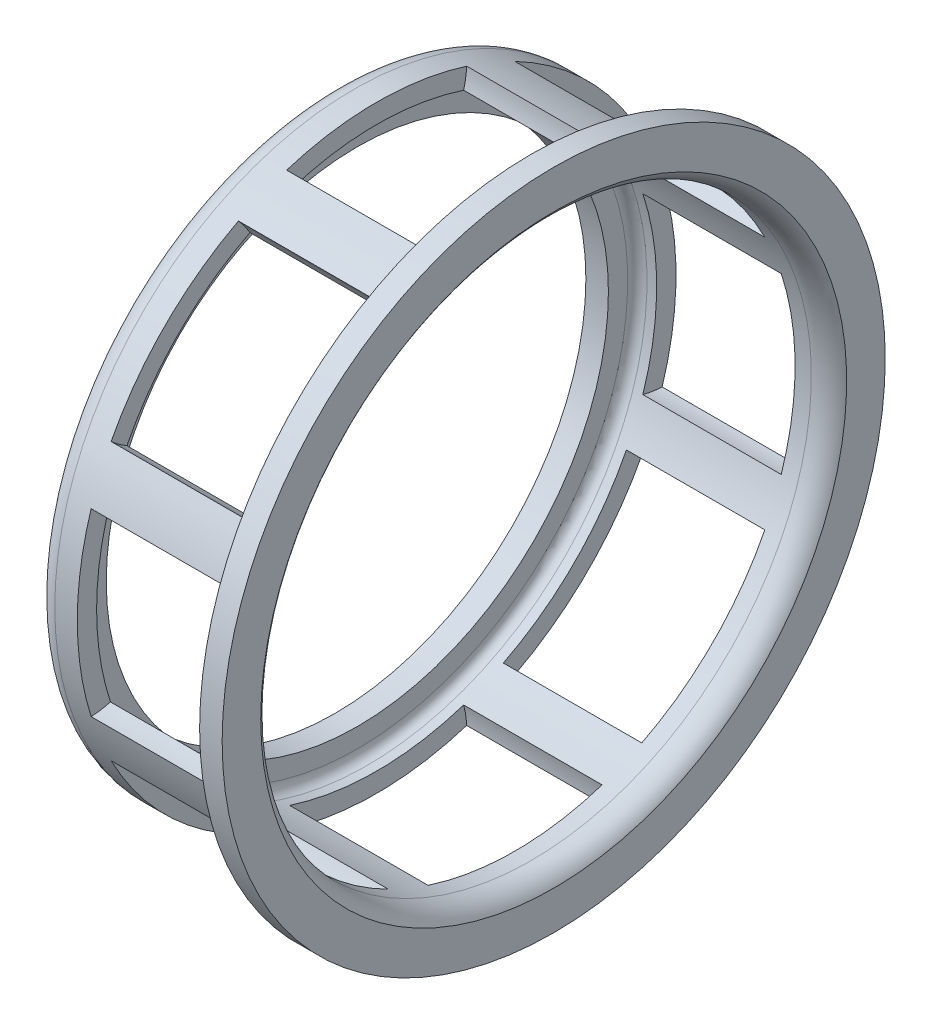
from build123d import *

# Parameters (mm, degrees)
ESQUISSE2_W                  = 4.3
ESQUISSE2_H                  = 2.8
R_P_TITION_CIRCULAIRE1_COUNT = 8


with BuildPart() as part:
    # Esquisse1 → Base-R_volution (revolve)
    with BuildSketch(Plane.XY, mode=Mode.PRIVATE) as base_r_volution_sk:
        with BuildLine():
            Line((-3.4, 7.8), (-3.4, 8.7))
            ThreePointArc((-3.4, 8.7), (-3.224264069, 9.124264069), (-2.8, 9.3))
            Line((-2.8, 9.3), (2.526794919, 9.3))
            ThreePointArc((2.526794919, 9.3), (2.7, 9.4), (2.7, 9.6))
            Line((2.7, 9.6), (2.7, 10.3))
            Line((2.7, 10.3), (3.4, 10.3))
            Line((3.4, 10.3), (3.4, 9.10157174))
            ThreePointArc((3.4, 9.10157174), (3.107059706, 8.807633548), (2.706274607, 8.7))
            Line((2.706274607, 8.7), (-2.4, 8.7))
            ThreePointArc((-2.4, 8.7), (-2.612132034, 8.612132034), (-2.7, 8.4))
            Line((-2.7, 8.4), (-2.7, 7.8))
            Line((-2.7, 7.8), (-3.4, 7.8))
        make_face()
    revolve(base_r_volution_sk.sketch.rotate(Axis((-5.6, 0, 0), (1, 0, 0)), 90), axis=Axis((-5.6, 0, 0), (1, 0, 0)))

    # Esquisse2 → Enlever de la mati_re-Pivoter1 (revolve, cut)
    with BuildSketch(Plane(origin=(0, 0, 0), x_dir=(1, 0, 0), z_dir=(0, 1, 0))):
        with Locations((0.05, 10.4)):
            Rectangle(ESQUISSE2_W, ESQUISSE2_H)
    enlever_de_la_mati_re_pivoter1 = revolve(axis=Axis((0, 0, -9), (1, 0, 0)), mode=Mode.SUBTRACT)

    # R_p_tition circulaire1: Enlever de la mati_re-Pivoter1 ×8 about axis
    r_p_tition_circulaire1_axis = Axis((-5.6, 0, 0), (1, 0, 0))
    for i in range(1, R_P_TITION_CIRCULAIRE1_COUNT):
        add(enlever_de_la_mati_re_pivoter1.rotate(r_p_tition_circulaire1_axis, i * 360 / R_P_TITION_CIRCULAIRE1_COUNT), mode=Mode.SUBTRACT)


solid = part.part
